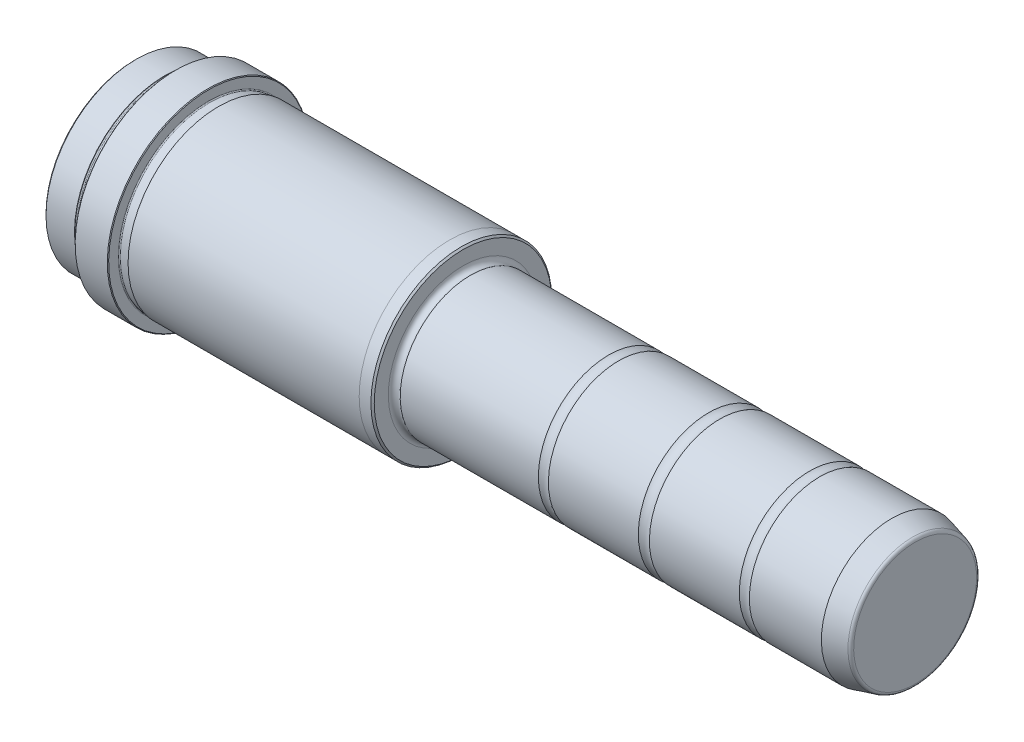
ISO-10303-21;
HEADER;
FILE_DESCRIPTION(('STEP AP214'),'2;1');
FILE_NAME('part.step','',(''),(''),'','','');
FILE_SCHEMA(('AUTOMOTIVE_DESIGN { 1 0 10303 214 1 1 1 1 }'));
ENDSEC;
DATA;
#1=APPLICATION_CONTEXT('core data for automotive mechanical design processes');
#2=APPLICATION_PROTOCOL_DEFINITION('international standard','automotive_design',2000,#1);
#3=PRODUCT_CONTEXT('',#1,'mechanical');
#4=PRODUCT('Part','Part','',(#3));
#5=PRODUCT_RELATED_PRODUCT_CATEGORY('part','',(#4));
#6=PRODUCT_DEFINITION_FORMATION('','',#4);
#7=PRODUCT_DEFINITION_CONTEXT('part definition',#1,'design');
#8=PRODUCT_DEFINITION('design','',#6,#7);
#9=PRODUCT_DEFINITION_SHAPE('','',#8);
#10=(LENGTH_UNIT() NAMED_UNIT(*) SI_UNIT(.MILLI.,.METRE.));
#11=(NAMED_UNIT(*) PLANE_ANGLE_UNIT() SI_UNIT($,.RADIAN.));
#12=(NAMED_UNIT(*) SI_UNIT($,.STERADIAN.) SOLID_ANGLE_UNIT());
#13=UNCERTAINTY_MEASURE_WITH_UNIT(LENGTH_MEASURE(1.E-05),#10,'distance_accuracy_value','');
#14=(GEOMETRIC_REPRESENTATION_CONTEXT(3) GLOBAL_UNCERTAINTY_ASSIGNED_CONTEXT((#13)) GLOBAL_UNIT_ASSIGNED_CONTEXT((#10,
#11,#12)) REPRESENTATION_CONTEXT('',''));
#15=CARTESIAN_POINT('',(0.,0.,0.));
#16=DIRECTION('',(0.,0.,1.));
#17=DIRECTION('',(1.,0.,0.));
#18=AXIS2_PLACEMENT_3D('',#15,#16,#17);
#19=CARTESIAN_POINT('',(135.,0.,0.));
#20=DIRECTION('',(1.,0.,0.));
#21=DIRECTION('',(0.,1.,0.));
#22=AXIS2_PLACEMENT_3D('',#19,#20,#21);
#23=CYLINDRICAL_SURFACE('',#22,21.);
#24=CARTESIAN_POINT('',(2.24833147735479,0.,0.));
#25=DIRECTION('',(1.,0.,0.));
#26=DIRECTION('',(0.,1.,0.));
#27=AXIS2_PLACEMENT_3D('',#24,#25,#26);
#28=CIRCLE('',#27,21.);
#29=CARTESIAN_POINT('',(2.24833147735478,21.,0.));
#30=VERTEX_POINT('',#29);
#31=EDGE_CURVE('E105',#30,#30,#28,.T.);
#32=ORIENTED_EDGE('',*,*,#31,.T.);
#33=EDGE_LOOP('',(#32));
#34=FACE_BOUND('',#33,.T.);
#35=CARTESIAN_POINT('',(43.5033370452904,0.,0.));
#36=DIRECTION('',(-1.,0.,0.));
#37=DIRECTION('',(0.,-1.,0.));
#38=AXIS2_PLACEMENT_3D('',#35,#36,#37);
#39=CIRCLE('',#38,21.);
#40=CARTESIAN_POINT('',(43.5033370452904,-20.9999999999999,0.));
#41=VERTEX_POINT('',#40);
#42=EDGE_CURVE('E126',#41,#41,#39,.T.);
#43=ORIENTED_EDGE('',*,*,#42,.T.);
#44=EDGE_LOOP('',(#43));
#45=FACE_BOUND('',#44,.T.);
#46=ADVANCED_FACE('F28',(#34,#45),#23,.T.);
#47=CARTESIAN_POINT('',(-98.,27.,0.));
#48=DIRECTION('',(-1.,0.,0.));
#49=DIRECTION('',(0.,-1.,0.));
#50=AXIS2_PLACEMENT_3D('',#47,#48,#49);
#51=PLANE('',#50);
#52=CARTESIAN_POINT('',(-98.,0.,0.));
#53=DIRECTION('',(-1.,0.,0.));
#54=DIRECTION('',(0.,-1.,0.));
#55=AXIS2_PLACEMENT_3D('',#52,#53,#54);
#56=CIRCLE('',#55,26.5000000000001);
#57=CARTESIAN_POINT('',(-97.9999999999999,-26.5000000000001,0.));
#58=VERTEX_POINT('',#57);
#59=EDGE_CURVE('E39',#58,#58,#56,.T.);
#60=ORIENTED_EDGE('',*,*,#59,.T.);
#61=EDGE_LOOP('',(#60));
#62=FACE_BOUND('',#61,.T.);
#63=ADVANCED_FACE('F149',(#62),#51,.T.);
#64=CARTESIAN_POINT('',(135.,0.,0.));
#65=DIRECTION('',(1.,0.,0.));
#66=DIRECTION('',(0.,1.,0.));
#67=AXIS2_PLACEMENT_3D('',#64,#65,#66);
#68=CYLINDRICAL_SURFACE('',#67,27.);
#69=CARTESIAN_POINT('',(-97.5,0.,0.));
#70=DIRECTION('',(-1.,0.,0.));
#71=DIRECTION('',(0.,-1.,0.));
#72=AXIS2_PLACEMENT_3D('',#69,#70,#71);
#73=CIRCLE('',#72,27.);
#74=CARTESIAN_POINT('',(-97.5,-27.,0.));
#75=VERTEX_POINT('',#74);
#76=EDGE_CURVE('E43',#75,#75,#73,.F.);
#77=ORIENTED_EDGE('',*,*,#76,.T.);
#78=EDGE_LOOP('',(#77));
#79=FACE_BOUND('',#78,.T.);
#80=CARTESIAN_POINT('',(-89.,0.,0.));
#81=DIRECTION('',(1.,0.,0.));
#82=DIRECTION('',(0.,1.,0.));
#83=AXIS2_PLACEMENT_3D('',#80,#81,#82);
#84=CIRCLE('',#83,27.);
#85=CARTESIAN_POINT('',(-89.,27.,0.));
#86=VERTEX_POINT('',#85);
#87=EDGE_CURVE('E66',#86,#86,#84,.T.);
#88=ORIENTED_EDGE('',*,*,#87,.F.);
#89=EDGE_LOOP('',(#88));
#90=FACE_BOUND('',#89,.T.);
#91=ADVANCED_FACE('F157',(#79,#90),#68,.T.);
#92=CARTESIAN_POINT('',(-89.,26.9,0.));
#93=DIRECTION('',(1.,0.,0.));
#94=DIRECTION('',(0.,1.,0.));
#95=AXIS2_PLACEMENT_3D('',#92,#93,#94);
#96=PLANE('',#95);
#97=ORIENTED_EDGE('',*,*,#87,.T.);
#98=EDGE_LOOP('',(#97));
#99=FACE_BOUND('',#98,.T.);
#100=CARTESIAN_POINT('',(-89.,0.,0.));
#101=DIRECTION('',(1.,0.,0.));
#102=DIRECTION('',(0.,1.,0.));
#103=AXIS2_PLACEMENT_3D('',#100,#101,#102);
#104=CIRCLE('',#103,26.9);
#105=CARTESIAN_POINT('',(-89.,26.9,0.));
#106=VERTEX_POINT('',#105);
#107=EDGE_CURVE('E69',#106,#106,#104,.T.);
#108=ORIENTED_EDGE('',*,*,#107,.F.);
#109=EDGE_LOOP('',(#108));
#110=FACE_BOUND('',#109,.T.);
#111=ADVANCED_FACE('F405',(#99,#110),#96,.T.);
#112=CARTESIAN_POINT('',(-88.7,0.,0.));
#113=DIRECTION('',(1.,0.,0.));
#114=DIRECTION('',(0.,1.,0.));
#115=AXIS2_PLACEMENT_3D('',#112,#113,#114);
#116=TOROIDAL_SURFACE('',#115,26.9,0.299999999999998);
#117=ORIENTED_EDGE('',*,*,#107,.T.);
#118=EDGE_LOOP('',(#117));
#119=FACE_BOUND('',#118,.T.);
#120=CARTESIAN_POINT('',(-88.7,0.,0.));
#121=DIRECTION('',(1.,0.,0.));
#122=DIRECTION('',(0.,1.,0.));
#123=AXIS2_PLACEMENT_3D('',#120,#121,#122);
#124=CIRCLE('',#123,26.6);
#125=CARTESIAN_POINT('',(-88.7,26.6,0.));
#126=VERTEX_POINT('',#125);
#127=EDGE_CURVE('E72',#126,#126,#124,.T.);
#128=ORIENTED_EDGE('',*,*,#127,.F.);
#129=EDGE_LOOP('',(#128));
#130=FACE_BOUND('',#129,.T.);
#131=ADVANCED_FACE('F396',(#119,#130),#116,.F.);
#132=CARTESIAN_POINT('',(135.,0.,0.));
#133=DIRECTION('',(1.,0.,0.));
#134=DIRECTION('',(0.,1.,0.));
#135=AXIS2_PLACEMENT_3D('',#132,#133,#134);
#136=CYLINDRICAL_SURFACE('',#135,26.6);
#137=ORIENTED_EDGE('',*,*,#127,.T.);
#138=EDGE_LOOP('',(#137));
#139=FACE_BOUND('',#138,.T.);
#140=CARTESIAN_POINT('',(-86.3,0.,0.));
#141=DIRECTION('',(1.,0.,0.));
#142=DIRECTION('',(0.,1.,0.));
#143=AXIS2_PLACEMENT_3D('',#140,#141,#142);
#144=CIRCLE('',#143,26.6);
#145=CARTESIAN_POINT('',(-86.3,26.6,0.));
#146=VERTEX_POINT('',#145);
#147=EDGE_CURVE('E75',#146,#146,#144,.T.);
#148=ORIENTED_EDGE('',*,*,#147,.F.);
#149=EDGE_LOOP('',(#148));
#150=FACE_BOUND('',#149,.T.);
#151=ADVANCED_FACE('F387',(#139,#150),#136,.T.);
#152=CARTESIAN_POINT('',(-86.3,0.,0.));
#153=DIRECTION('',(1.,0.,0.));
#154=DIRECTION('',(0.,1.,0.));
#155=AXIS2_PLACEMENT_3D('',#152,#153,#154);
#156=TOROIDAL_SURFACE('',#155,26.9,0.299999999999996);
#157=ORIENTED_EDGE('',*,*,#147,.T.);
#158=EDGE_LOOP('',(#157));
#159=FACE_BOUND('',#158,.T.);
#160=CARTESIAN_POINT('',(-86.,0.,0.));
#161=DIRECTION('',(1.,0.,0.));
#162=DIRECTION('',(0.,1.,0.));
#163=AXIS2_PLACEMENT_3D('',#160,#161,#162);
#164=CIRCLE('',#163,26.9);
#165=CARTESIAN_POINT('',(-86.,26.9,0.));
#166=VERTEX_POINT('',#165);
#167=EDGE_CURVE('E78',#166,#166,#164,.T.);
#168=ORIENTED_EDGE('',*,*,#167,.F.);
#169=EDGE_LOOP('',(#168));
#170=FACE_BOUND('',#169,.T.);
#171=ADVANCED_FACE('F379',(#159,#170),#156,.F.);
#172=CARTESIAN_POINT('',(-86.,30.,0.));
#173=DIRECTION('',(-1.,0.,0.));
#174=DIRECTION('',(0.,-1.,0.));
#175=AXIS2_PLACEMENT_3D('',#172,#173,#174);
#176=PLANE('',#175);
#177=CARTESIAN_POINT('',(-86.,0.,0.));
#178=DIRECTION('',(-1.,0.,0.));
#179=DIRECTION('',(0.,-1.,0.));
#180=AXIS2_PLACEMENT_3D('',#177,#178,#179);
#181=CIRCLE('',#180,29.8);
#182=CARTESIAN_POINT('',(-86.,-29.8,0.));
#183=VERTEX_POINT('',#182);
#184=EDGE_CURVE('E51',#183,#183,#181,.T.);
#185=ORIENTED_EDGE('',*,*,#184,.T.);
#186=EDGE_LOOP('',(#185));
#187=FACE_BOUND('',#186,.T.);
#188=ORIENTED_EDGE('',*,*,#167,.T.);
#189=EDGE_LOOP('',(#188));
#190=FACE_BOUND('',#189,.T.);
#191=ADVANCED_FACE('F371',(#187,#190),#176,.T.);
#192=CARTESIAN_POINT('',(135.,0.,0.));
#193=DIRECTION('',(1.,0.,0.));
#194=DIRECTION('',(0.,1.,0.));
#195=AXIS2_PLACEMENT_3D('',#192,#193,#194);
#196=CYLINDRICAL_SURFACE('',#195,30.);
#197=CARTESIAN_POINT('',(-85.8,0.,0.));
#198=DIRECTION('',(-1.,0.,0.));
#199=DIRECTION('',(0.,-1.,0.));
#200=AXIS2_PLACEMENT_3D('',#197,#198,#199);
#201=CIRCLE('',#200,30.);
#202=CARTESIAN_POINT('',(-85.8,-30.,0.));
#203=VERTEX_POINT('',#202);
#204=EDGE_CURVE('E54',#203,#203,#201,.F.);
#205=ORIENTED_EDGE('',*,*,#204,.T.);
#206=EDGE_LOOP('',(#205));
#207=FACE_BOUND('',#206,.T.);
#208=CARTESIAN_POINT('',(-76.2,0.,0.));
#209=DIRECTION('',(1.,0.,0.));
#210=DIRECTION('',(0.,1.,0.));
#211=AXIS2_PLACEMENT_3D('',#208,#209,#210);
#212=CIRCLE('',#211,30.);
#213=CARTESIAN_POINT('',(-76.1999999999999,-30.,0.));
#214=VERTEX_POINT('',#213);
#215=EDGE_CURVE('E57',#214,#214,#212,.F.);
#216=ORIENTED_EDGE('',*,*,#215,.T.);
#217=EDGE_LOOP('',(#216));
#218=FACE_BOUND('',#217,.T.);
#219=ADVANCED_FACE('F362',(#207,#218),#196,.T.);
#220=CARTESIAN_POINT('',(-76.,26.9,0.));
#221=DIRECTION('',(1.,0.,0.));
#222=DIRECTION('',(0.,1.,0.));
#223=AXIS2_PLACEMENT_3D('',#220,#221,#222);
#224=PLANE('',#223);
#225=CARTESIAN_POINT('',(-76.,0.,0.));
#226=DIRECTION('',(1.,0.,0.));
#227=DIRECTION('',(0.,1.,0.));
#228=AXIS2_PLACEMENT_3D('',#225,#226,#227);
#229=CIRCLE('',#228,29.8);
#230=CARTESIAN_POINT('',(-76.,-29.8,0.));
#231=VERTEX_POINT('',#230);
#232=EDGE_CURVE('E48',#231,#231,#229,.T.);
#233=ORIENTED_EDGE('',*,*,#232,.T.);
#234=EDGE_LOOP('',(#233));
#235=FACE_BOUND('',#234,.T.);
#236=CARTESIAN_POINT('',(-76.,0.,0.));
#237=DIRECTION('',(1.,0.,0.));
#238=DIRECTION('',(0.,1.,0.));
#239=AXIS2_PLACEMENT_3D('',#236,#237,#238);
#240=CIRCLE('',#239,26.9);
#241=CARTESIAN_POINT('',(-76.,26.9,0.));
#242=VERTEX_POINT('',#241);
#243=EDGE_CURVE('E81',#242,#242,#240,.T.);
#244=ORIENTED_EDGE('',*,*,#243,.F.);
#245=EDGE_LOOP('',(#244));
#246=FACE_BOUND('',#245,.T.);
#247=ADVANCED_FACE('F353',(#235,#246),#224,.T.);
#248=CARTESIAN_POINT('',(-75.7,0.,0.));
#249=DIRECTION('',(1.,0.,0.));
#250=DIRECTION('',(0.,1.,0.));
#251=AXIS2_PLACEMENT_3D('',#248,#249,#250);
#252=TOROIDAL_SURFACE('',#251,26.9,0.299999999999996);
#253=ORIENTED_EDGE('',*,*,#243,.T.);
#254=EDGE_LOOP('',(#253));
#255=FACE_BOUND('',#254,.T.);
#256=CARTESIAN_POINT('',(-75.7,0.,0.));
#257=DIRECTION('',(1.,0.,0.));
#258=DIRECTION('',(0.,1.,0.));
#259=AXIS2_PLACEMENT_3D('',#256,#257,#258);
#260=CIRCLE('',#259,26.6);
#261=CARTESIAN_POINT('',(-75.7,26.6,0.));
#262=VERTEX_POINT('',#261);
#263=EDGE_CURVE('E84',#262,#262,#260,.T.);
#264=ORIENTED_EDGE('',*,*,#263,.F.);
#265=EDGE_LOOP('',(#264));
#266=FACE_BOUND('',#265,.T.);
#267=ADVANCED_FACE('F344',(#255,#266),#252,.F.);
#268=CARTESIAN_POINT('',(135.,0.,0.));
#269=DIRECTION('',(1.,0.,0.));
#270=DIRECTION('',(0.,1.,0.));
#271=AXIS2_PLACEMENT_3D('',#268,#269,#270);
#272=CYLINDRICAL_SURFACE('',#271,26.6);
#273=ORIENTED_EDGE('',*,*,#263,.T.);
#274=EDGE_LOOP('',(#273));
#275=FACE_BOUND('',#274,.T.);
#276=CARTESIAN_POINT('',(-73.3,0.,0.));
#277=DIRECTION('',(1.,0.,0.));
#278=DIRECTION('',(0.,1.,0.));
#279=AXIS2_PLACEMENT_3D('',#276,#277,#278);
#280=CIRCLE('',#279,26.6);
#281=CARTESIAN_POINT('',(-73.3,26.6,0.));
#282=VERTEX_POINT('',#281);
#283=EDGE_CURVE('E87',#282,#282,#280,.T.);
#284=ORIENTED_EDGE('',*,*,#283,.F.);
#285=EDGE_LOOP('',(#284));
#286=FACE_BOUND('',#285,.T.);
#287=ADVANCED_FACE('F335',(#275,#286),#272,.T.);
#288=CARTESIAN_POINT('',(-73.3,0.,0.));
#289=DIRECTION('',(1.,0.,0.));
#290=DIRECTION('',(0.,1.,0.));
#291=AXIS2_PLACEMENT_3D('',#288,#289,#290);
#292=TOROIDAL_SURFACE('',#291,26.9,0.299999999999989);
#293=ORIENTED_EDGE('',*,*,#283,.T.);
#294=EDGE_LOOP('',(#293));
#295=FACE_BOUND('',#294,.T.);
#296=CARTESIAN_POINT('',(-73.,0.,0.));
#297=DIRECTION('',(1.,0.,0.));
#298=DIRECTION('',(0.,1.,0.));
#299=AXIS2_PLACEMENT_3D('',#296,#297,#298);
#300=CIRCLE('',#299,26.9);
#301=CARTESIAN_POINT('',(-73.,26.9,0.));
#302=VERTEX_POINT('',#301);
#303=EDGE_CURVE('E90',#302,#302,#300,.T.);
#304=ORIENTED_EDGE('',*,*,#303,.F.);
#305=EDGE_LOOP('',(#304));
#306=FACE_BOUND('',#305,.T.);
#307=ADVANCED_FACE('F326',(#295,#306),#292,.F.);
#308=CARTESIAN_POINT('',(-73.,27.0001,0.));
#309=DIRECTION('',(-1.,0.,0.));
#310=DIRECTION('',(0.,-1.,0.));
#311=AXIS2_PLACEMENT_3D('',#308,#309,#310);
#312=PLANE('',#311);
#313=ORIENTED_EDGE('',*,*,#303,.T.);
#314=EDGE_LOOP('',(#313));
#315=FACE_BOUND('',#314,.T.);
#316=CARTESIAN_POINT('',(-73.,0.,0.));
#317=DIRECTION('',(1.,0.,0.));
#318=DIRECTION('',(0.,1.,0.));
#319=AXIS2_PLACEMENT_3D('',#316,#317,#318);
#320=CIRCLE('',#319,27.0001);
#321=CARTESIAN_POINT('',(-73.,27.0001,0.));
#322=VERTEX_POINT('',#321);
#323=EDGE_CURVE('E93',#322,#322,#320,.T.);
#324=ORIENTED_EDGE('',*,*,#323,.F.);
#325=EDGE_LOOP('',(#324));
#326=FACE_BOUND('',#325,.T.);
#327=ADVANCED_FACE('F317',(#315,#326),#312,.T.);
#328=CARTESIAN_POINT('',(135.,0.,0.));
#329=DIRECTION('',(1.,0.,0.));
#330=DIRECTION('',(0.,1.,0.));
#331=AXIS2_PLACEMENT_3D('',#328,#329,#330);
#332=CYLINDRICAL_SURFACE('',#331,27.0001);
#333=ORIENTED_EDGE('',*,*,#323,.T.);
#334=EDGE_LOOP('',(#333));
#335=FACE_BOUND('',#334,.T.);
#336=CARTESIAN_POINT('',(-4.,0.,0.));
#337=DIRECTION('',(1.,0.,0.));
#338=DIRECTION('',(0.,1.,0.));
#339=AXIS2_PLACEMENT_3D('',#336,#337,#338);
#340=CIRCLE('',#339,27.0001);
#341=CARTESIAN_POINT('',(-4.00000000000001,27.0001,0.));
#342=VERTEX_POINT('',#341);
#343=EDGE_CURVE('E96',#342,#342,#340,.T.);
#344=ORIENTED_EDGE('',*,*,#343,.F.);
#345=EDGE_LOOP('',(#344));
#346=FACE_BOUND('',#345,.T.);
#347=ADVANCED_FACE('F308',(#335,#346),#332,.T.);
#348=CARTESIAN_POINT('',(-4.,27.0001,0.));
#349=DIRECTION('',(1.,0.,0.));
#350=DIRECTION('',(0.,1.,0.));
#351=AXIS2_PLACEMENT_3D('',#348,#349,#350);
#352=PLANE('',#351);
#353=ORIENTED_EDGE('',*,*,#343,.T.);
#354=EDGE_LOOP('',(#353));
#355=FACE_BOUND('',#354,.T.);
#356=CARTESIAN_POINT('',(-4.,0.,0.));
#357=DIRECTION('',(1.,0.,0.));
#358=DIRECTION('',(0.,1.,0.));
#359=AXIS2_PLACEMENT_3D('',#356,#357,#358);
#360=CIRCLE('',#359,27.);
#361=CARTESIAN_POINT('',(-4.00000000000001,27.,0.));
#362=VERTEX_POINT('',#361);
#363=EDGE_CURVE('E99',#362,#362,#360,.T.);
#364=ORIENTED_EDGE('',*,*,#363,.F.);
#365=EDGE_LOOP('',(#364));
#366=FACE_BOUND('',#365,.T.);
#367=ADVANCED_FACE('F300',(#355,#366),#352,.T.);
#368=CARTESIAN_POINT('',(135.,0.,0.));
#369=DIRECTION('',(1.,0.,0.));
#370=DIRECTION('',(0.,1.,0.));
#371=AXIS2_PLACEMENT_3D('',#368,#369,#370);
#372=CYLINDRICAL_SURFACE('',#371,27.);
#373=CARTESIAN_POINT('',(-0.499999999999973,0.,0.));
#374=DIRECTION('',(1.,0.,0.));
#375=DIRECTION('',(0.,1.,0.));
#376=AXIS2_PLACEMENT_3D('',#373,#374,#375);
#377=CIRCLE('',#376,27.);
#378=CARTESIAN_POINT('',(-0.499999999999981,27.,0.));
#379=VERTEX_POINT('',#378);
#380=EDGE_CURVE('E10',#379,#379,#377,.F.);
#381=ORIENTED_EDGE('',*,*,#380,.T.);
#382=EDGE_LOOP('',(#381));
#383=FACE_BOUND('',#382,.T.);
#384=ORIENTED_EDGE('',*,*,#363,.T.);
#385=EDGE_LOOP('',(#384));
#386=FACE_BOUND('',#385,.T.);
#387=ADVANCED_FACE('F292',(#383,#386),#372,.T.);
#388=CARTESIAN_POINT('',(0.,22.3,0.));
#389=DIRECTION('',(1.,0.,0.));
#390=DIRECTION('',(0.,1.,0.));
#391=AXIS2_PLACEMENT_3D('',#388,#389,#390);
#392=PLANE('',#391);
#393=CARTESIAN_POINT('',(0.,0.,0.));
#394=DIRECTION('',(1.,0.,0.));
#395=DIRECTION('',(0.,1.,0.));
#396=AXIS2_PLACEMENT_3D('',#393,#394,#395);
#397=CIRCLE('',#396,26.5);
#398=CARTESIAN_POINT('',(0.,26.5,0.));
#399=VERTEX_POINT('',#398);
#400=EDGE_CURVE('E35',#399,#399,#397,.T.);
#401=ORIENTED_EDGE('',*,*,#400,.T.);
#402=EDGE_LOOP('',(#401));
#403=FACE_BOUND('',#402,.T.);
#404=CARTESIAN_POINT('',(0.,0.,0.));
#405=DIRECTION('',(1.,0.,0.));
#406=DIRECTION('',(0.,1.,0.));
#407=AXIS2_PLACEMENT_3D('',#404,#405,#406);
#408=CIRCLE('',#407,22.3);
#409=CARTESIAN_POINT('',(0.,22.3,0.));
#410=VERTEX_POINT('',#409);
#411=EDGE_CURVE('E102',#410,#410,#408,.T.);
#412=ORIENTED_EDGE('',*,*,#411,.F.);
#413=EDGE_LOOP('',(#412));
#414=FACE_BOUND('',#413,.T.);
#415=ADVANCED_FACE('F144',(#403,#414),#392,.T.);
#416=CARTESIAN_POINT('',(1.5,0.,0.));
#417=DIRECTION('',(1.,0.,0.));
#418=DIRECTION('',(0.,1.,0.));
#419=AXIS2_PLACEMENT_3D('',#416,#417,#418);
#420=TOROIDAL_SURFACE('',#419,22.3,1.5);
#421=ORIENTED_EDGE('',*,*,#411,.T.);
#422=EDGE_LOOP('',(#421));
#423=FACE_BOUND('',#422,.T.);
#424=ORIENTED_EDGE('',*,*,#31,.F.);
#425=EDGE_LOOP('',(#424));
#426=FACE_BOUND('',#425,.T.);
#427=ADVANCED_FACE('F134',(#423,#426),#420,.F.);
#428=CARTESIAN_POINT('',(45.,0.,0.));
#429=DIRECTION('',(-1.,0.,0.));
#430=DIRECTION('',(0.,-1.,0.));
#431=AXIS2_PLACEMENT_3D('',#428,#429,#430);
#432=TOROIDAL_SURFACE('',#431,23.6,3.);
#433=CARTESIAN_POINT('',(46.4966629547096,0.,0.));
#434=DIRECTION('',(-1.,0.,0.));
#435=DIRECTION('',(0.,-1.,0.));
#436=AXIS2_PLACEMENT_3D('',#433,#434,#435);
#437=CIRCLE('',#436,21.);
#438=CARTESIAN_POINT('',(46.4966629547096,-20.9999999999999,0.));
#439=VERTEX_POINT('',#438);
#440=EDGE_CURVE('E123',#439,#439,#437,.T.);
#441=ORIENTED_EDGE('',*,*,#440,.T.);
#442=EDGE_LOOP('',(#441));
#443=FACE_BOUND('',#442,.T.);
#444=ORIENTED_EDGE('',*,*,#42,.F.);
#445=EDGE_LOOP('',(#444));
#446=FACE_BOUND('',#445,.T.);
#447=ADVANCED_FACE('F131',(#443,#446),#432,.F.);
#448=CARTESIAN_POINT('',(135.,19.1243556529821,0.));
#449=DIRECTION('',(1.,0.,0.));
#450=DIRECTION('',(0.,1.,0.));
#451=AXIS2_PLACEMENT_3D('',#448,#449,#450);
#452=PLANE('',#451);
#453=CARTESIAN_POINT('',(135.,0.,0.));
#454=DIRECTION('',(1.,0.,0.));
#455=DIRECTION('',(0.,1.,0.));
#456=AXIS2_PLACEMENT_3D('',#453,#454,#455);
#457=CIRCLE('',#456,18.3570286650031);
#458=CARTESIAN_POINT('',(135.,18.3570286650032,0.));
#459=VERTEX_POINT('',#458);
#460=EDGE_CURVE('E63',#459,#459,#457,.T.);
#461=ORIENTED_EDGE('',*,*,#460,.T.);
#462=EDGE_LOOP('',(#461));
#463=FACE_BOUND('',#462,.T.);
#464=ADVANCED_FACE('F133',(#463),#452,.T.);
#465=CARTESIAN_POINT('',(135.,0.,0.));
#466=DIRECTION('',(-1.,0.,0.));
#467=DIRECTION('',(0.,-1.,0.));
#468=AXIS2_PLACEMENT_3D('',#465,#466,#467);
#469=CONICAL_SURFACE('',#468,19.1243556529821,0.26179938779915);
#470=CARTESIAN_POINT('',(134.258819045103,0.,0.));
#471=DIRECTION('',(1.,0.,0.));
#472=DIRECTION('',(0.,1.,0.));
#473=AXIS2_PLACEMENT_3D('',#470,#471,#472);
#474=CIRCLE('',#473,19.3229544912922);
#475=CARTESIAN_POINT('',(134.258819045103,19.3229544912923,0.));
#476=VERTEX_POINT('',#475);
#477=EDGE_CURVE('E60',#476,#476,#474,.F.);
#478=ORIENTED_EDGE('',*,*,#477,.T.);
#479=EDGE_LOOP('',(#478));
#480=FACE_BOUND('',#479,.T.);
#481=CARTESIAN_POINT('',(128.,0.,0.));
#482=DIRECTION('',(1.,0.,0.));
#483=DIRECTION('',(0.,1.,0.));
#484=AXIS2_PLACEMENT_3D('',#481,#482,#483);
#485=CIRCLE('',#484,21.);
#486=CARTESIAN_POINT('',(128.,21.,0.));
#487=VERTEX_POINT('',#486);
#488=EDGE_CURVE('E108',#487,#487,#485,.T.);
#489=ORIENTED_EDGE('',*,*,#488,.T.);
#490=EDGE_LOOP('',(#489));
#491=FACE_BOUND('',#490,.T.);
#492=ADVANCED_FACE('F141',(#480,#491),#469,.T.);
#493=ORIENTED_EDGE('',*,*,#488,.F.);
#494=EDGE_LOOP('',(#493));
#495=FACE_BOUND('',#494,.T.);
#496=CARTESIAN_POINT('',(106.49666295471,0.,0.));
#497=DIRECTION('',(-1.,0.,0.));
#498=DIRECTION('',(0.,-1.,0.));
#499=AXIS2_PLACEMENT_3D('',#496,#497,#498);
#500=CIRCLE('',#499,21.);
#501=CARTESIAN_POINT('',(106.49666295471,-20.9999999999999,0.));
#502=VERTEX_POINT('',#501);
#503=EDGE_CURVE('E111',#502,#502,#500,.T.);
#504=ORIENTED_EDGE('',*,*,#503,.F.);
#505=EDGE_LOOP('',(#504));
#506=FACE_BOUND('',#505,.T.);
#507=ADVANCED_FACE('F153',(#495,#506),#23,.T.);
#508=CARTESIAN_POINT('',(105.,0.,0.));
#509=DIRECTION('',(-1.,0.,0.));
#510=DIRECTION('',(0.,-1.,0.));
#511=AXIS2_PLACEMENT_3D('',#508,#509,#510);
#512=TOROIDAL_SURFACE('',#511,23.6,3.);
#513=ORIENTED_EDGE('',*,*,#503,.T.);
#514=EDGE_LOOP('',(#513));
#515=FACE_BOUND('',#514,.T.);
#516=CARTESIAN_POINT('',(103.50333704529,0.,0.));
#517=DIRECTION('',(-1.,0.,0.));
#518=DIRECTION('',(0.,-1.,0.));
#519=AXIS2_PLACEMENT_3D('',#516,#517,#518);
#520=CIRCLE('',#519,21.);
#521=CARTESIAN_POINT('',(103.50333704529,-20.9999999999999,0.));
#522=VERTEX_POINT('',#521);
#523=EDGE_CURVE('E114',#522,#522,#520,.T.);
#524=ORIENTED_EDGE('',*,*,#523,.F.);
#525=EDGE_LOOP('',(#524));
#526=FACE_BOUND('',#525,.T.);
#527=ADVANCED_FACE('F167',(#515,#526),#512,.F.);
#528=ORIENTED_EDGE('',*,*,#523,.T.);
#529=EDGE_LOOP('',(#528));
#530=FACE_BOUND('',#529,.T.);
#531=CARTESIAN_POINT('',(76.6583123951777,0.,0.));
#532=DIRECTION('',(-1.,0.,0.));
#533=DIRECTION('',(0.,-1.,0.));
#534=AXIS2_PLACEMENT_3D('',#531,#532,#533);
#535=CIRCLE('',#534,21.);
#536=CARTESIAN_POINT('',(76.6583123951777,-20.9999999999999,0.));
#537=VERTEX_POINT('',#536);
#538=EDGE_CURVE('E117',#537,#537,#535,.T.);
#539=ORIENTED_EDGE('',*,*,#538,.F.);
#540=EDGE_LOOP('',(#539));
#541=FACE_BOUND('',#540,.T.);
#542=ADVANCED_FACE('F165',(#530,#541),#23,.T.);
#543=CARTESIAN_POINT('',(75.,0.,0.));
#544=DIRECTION('',(-1.,0.,0.));
#545=DIRECTION('',(0.,-1.,0.));
#546=AXIS2_PLACEMENT_3D('',#543,#544,#545);
#547=TOROIDAL_SURFACE('',#546,23.5,3.);
#548=ORIENTED_EDGE('',*,*,#538,.T.);
#549=EDGE_LOOP('',(#548));
#550=FACE_BOUND('',#549,.T.);
#551=CARTESIAN_POINT('',(73.3416876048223,0.,0.));
#552=DIRECTION('',(-1.,0.,0.));
#553=DIRECTION('',(0.,-1.,0.));
#554=AXIS2_PLACEMENT_3D('',#551,#552,#553);
#555=CIRCLE('',#554,21.);
#556=CARTESIAN_POINT('',(73.3416876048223,-20.9999999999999,0.));
#557=VERTEX_POINT('',#556);
#558=EDGE_CURVE('E120',#557,#557,#555,.T.);
#559=ORIENTED_EDGE('',*,*,#558,.F.);
#560=EDGE_LOOP('',(#559));
#561=FACE_BOUND('',#560,.T.);
#562=ADVANCED_FACE('F163',(#550,#561),#547,.F.);
#563=ORIENTED_EDGE('',*,*,#558,.T.);
#564=EDGE_LOOP('',(#563));
#565=FACE_BOUND('',#564,.T.);
#566=ORIENTED_EDGE('',*,*,#440,.F.);
#567=EDGE_LOOP('',(#566));
#568=FACE_BOUND('',#567,.T.);
#569=ADVANCED_FACE('F152',(#565,#568),#23,.T.);
#570=CARTESIAN_POINT('',(134.,0.,0.));
#571=DIRECTION('',(1.,0.,0.));
#572=DIRECTION('',(0.,1.,0.));
#573=AXIS2_PLACEMENT_3D('',#570,#571,#572);
#574=TOROIDAL_SURFACE('',#573,18.3570286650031,1.);
#575=ORIENTED_EDGE('',*,*,#477,.F.);
#576=EDGE_LOOP('',(#575));
#577=FACE_BOUND('',#576,.T.);
#578=ORIENTED_EDGE('',*,*,#460,.F.);
#579=EDGE_LOOP('',(#578));
#580=FACE_BOUND('',#579,.T.);
#581=ADVANCED_FACE('F162',(#577,#580),#574,.T.);
#582=CARTESIAN_POINT('',(-85.8,0.,0.));
#583=DIRECTION('',(1.,0.,0.));
#584=DIRECTION('',(0.,1.,0.));
#585=AXIS2_PLACEMENT_3D('',#582,#583,#584);
#586=CONICAL_SURFACE('',#585,30.,0.785398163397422);
#587=ORIENTED_EDGE('',*,*,#184,.F.);
#588=EDGE_LOOP('',(#587));
#589=FACE_BOUND('',#588,.T.);
#590=ORIENTED_EDGE('',*,*,#204,.F.);
#591=EDGE_LOOP('',(#590));
#592=FACE_BOUND('',#591,.T.);
#593=ADVANCED_FACE('F205',(#589,#592),#586,.T.);
#594=CARTESIAN_POINT('',(-76.,0.,0.));
#595=DIRECTION('',(-1.,0.,0.));
#596=DIRECTION('',(0.,-1.,0.));
#597=AXIS2_PLACEMENT_3D('',#594,#595,#596);
#598=CONICAL_SURFACE('',#597,29.8,0.785398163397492);
#599=CARTESIAN_POINT('',(-76.1999999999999,-30.,0.));
#600=CARTESIAN_POINT('',(-76.1979166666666,-29.9979166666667,0.));
#601=CARTESIAN_POINT('',(-76.1958333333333,-29.9958333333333,0.));
#602=CARTESIAN_POINT('',(-76.1916666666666,-29.9916666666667,0.));
#603=CARTESIAN_POINT('',(-76.1895833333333,-29.9895833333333,0.));
#604=CARTESIAN_POINT('',(-76.1854166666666,-29.9854166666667,0.));
#605=CARTESIAN_POINT('',(-76.1833333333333,-29.9833333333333,0.));
#606=CARTESIAN_POINT('',(-76.1791666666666,-29.9791666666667,0.));
#607=CARTESIAN_POINT('',(-76.1770833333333,-29.9770833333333,0.));
#608=CARTESIAN_POINT('',(-76.1729166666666,-29.9729166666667,0.));
#609=CARTESIAN_POINT('',(-76.1708333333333,-29.9708333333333,0.));
#610=CARTESIAN_POINT('',(-76.1666666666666,-29.9666666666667,0.));
#611=CARTESIAN_POINT('',(-76.1645833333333,-29.9645833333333,0.));
#612=CARTESIAN_POINT('',(-76.1604166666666,-29.9604166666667,0.));
#613=CARTESIAN_POINT('',(-76.1583333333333,-29.9583333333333,0.));
#614=CARTESIAN_POINT('',(-76.1541666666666,-29.9541666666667,0.));
#615=CARTESIAN_POINT('',(-76.1520833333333,-29.9520833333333,0.));
#616=CARTESIAN_POINT('',(-76.1479166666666,-29.9479166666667,0.));
#617=CARTESIAN_POINT('',(-76.1458333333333,-29.9458333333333,0.));
#618=CARTESIAN_POINT('',(-76.1416666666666,-29.9416666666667,0.));
#619=CARTESIAN_POINT('',(-76.1395833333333,-29.9395833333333,0.));
#620=CARTESIAN_POINT('',(-76.1354166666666,-29.9354166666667,0.));
#621=CARTESIAN_POINT('',(-76.1333333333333,-29.9333333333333,0.));
#622=CARTESIAN_POINT('',(-76.1291666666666,-29.9291666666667,0.));
#623=CARTESIAN_POINT('',(-76.1270833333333,-29.9270833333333,0.));
#624=CARTESIAN_POINT('',(-76.1229166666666,-29.9229166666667,0.));
#625=CARTESIAN_POINT('',(-76.1208333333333,-29.9208333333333,0.));
#626=CARTESIAN_POINT('',(-76.1166666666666,-29.9166666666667,0.));
#627=CARTESIAN_POINT('',(-76.1145833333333,-29.9145833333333,0.));
#628=CARTESIAN_POINT('',(-76.1104166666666,-29.9104166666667,0.));
#629=CARTESIAN_POINT('',(-76.1083333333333,-29.9083333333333,0.));
#630=CARTESIAN_POINT('',(-76.1041666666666,-29.9041666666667,0.));
#631=CARTESIAN_POINT('',(-76.1020833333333,-29.9020833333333,0.));
#632=CARTESIAN_POINT('',(-76.0979166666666,-29.8979166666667,0.));
#633=CARTESIAN_POINT('',(-76.0958333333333,-29.8958333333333,0.));
#634=CARTESIAN_POINT('',(-76.0916666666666,-29.8916666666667,0.));
#635=CARTESIAN_POINT('',(-76.0895833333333,-29.8895833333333,0.));
#636=CARTESIAN_POINT('',(-76.0854166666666,-29.8854166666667,0.));
#637=CARTESIAN_POINT('',(-76.0833333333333,-29.8833333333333,0.));
#638=CARTESIAN_POINT('',(-76.0791666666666,-29.8791666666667,0.));
#639=CARTESIAN_POINT('',(-76.0770833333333,-29.8770833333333,0.));
#640=CARTESIAN_POINT('',(-76.0729166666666,-29.8729166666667,0.));
#641=CARTESIAN_POINT('',(-76.0708333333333,-29.8708333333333,0.));
#642=CARTESIAN_POINT('',(-76.0666666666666,-29.8666666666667,0.));
#643=CARTESIAN_POINT('',(-76.0645833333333,-29.8645833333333,0.));
#644=CARTESIAN_POINT('',(-76.0604166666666,-29.8604166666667,0.));
#645=CARTESIAN_POINT('',(-76.0583333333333,-29.8583333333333,0.));
#646=CARTESIAN_POINT('',(-76.0541666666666,-29.8541666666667,0.));
#647=CARTESIAN_POINT('',(-76.0520833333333,-29.8520833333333,0.));
#648=CARTESIAN_POINT('',(-76.0479166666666,-29.8479166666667,0.));
#649=CARTESIAN_POINT('',(-76.0458333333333,-29.8458333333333,0.));
#650=CARTESIAN_POINT('',(-76.0416666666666,-29.8416666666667,0.));
#651=CARTESIAN_POINT('',(-76.0395833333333,-29.8395833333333,0.));
#652=CARTESIAN_POINT('',(-76.0354166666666,-29.8354166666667,0.));
#653=CARTESIAN_POINT('',(-76.0333333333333,-29.8333333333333,0.));
#654=CARTESIAN_POINT('',(-76.0291666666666,-29.8291666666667,0.));
#655=CARTESIAN_POINT('',(-76.0270833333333,-29.8270833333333,0.));
#656=CARTESIAN_POINT('',(-76.0229166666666,-29.8229166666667,0.));
#657=CARTESIAN_POINT('',(-76.0208333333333,-29.8208333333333,0.));
#658=CARTESIAN_POINT('',(-76.0166666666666,-29.8166666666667,0.));
#659=CARTESIAN_POINT('',(-76.0145833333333,-29.8145833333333,0.));
#660=CARTESIAN_POINT('',(-76.0104166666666,-29.8104166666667,0.));
#661=CARTESIAN_POINT('',(-76.0083333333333,-29.8083333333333,0.));
#662=CARTESIAN_POINT('',(-76.0041666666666,-29.8041666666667,0.));
#663=CARTESIAN_POINT('',(-76.0020833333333,-29.8020833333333,0.));
#664=CARTESIAN_POINT('',(-76.,-29.8,0.));
#665=B_SPLINE_CURVE_WITH_KNOTS('',3,(#599,#600,#601,#602,#603,#604,#605,#606,#607,#608,#609,
#610,#611,#612,#613,#614,#615,#616,#617,#618,#619,#620,#621,#622,#623,#624,#625,#626,#627,#628,
#629,#630,#631,#632,#633,#634,#635,#636,#637,#638,#639,#640,#641,#642,#643,#644,#645,#646,#647,
#648,#649,#650,#651,#652,#653,#654,#655,#656,#657,#658,#659,#660,#661,#662,#663,#664),
.UNSPECIFIED.,.F.,.F.,(4,2,2,2,2,2,2,2,2,2,2,2,2,2,2,2,2,2,2,2,2,2,2,2,2,2,2,2,2,2,2,2,4),(0.,
0.00883883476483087,0.0176776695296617,0.0265165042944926,0.0353553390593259,0.0441941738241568,
0.0530330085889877,0.0618718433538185,0.0707106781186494,0.0795495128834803,0.0883883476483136,
0.0972271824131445,0.106066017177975,0.114904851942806,0.123743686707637,0.132582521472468,
0.141421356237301,0.150260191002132,0.159099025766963,0.167937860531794,0.176776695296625,
0.185615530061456,0.194454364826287,0.20329319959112,0.212132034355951,0.220970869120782,
0.229809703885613,0.238648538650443,0.247487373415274,0.256326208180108,0.265165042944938,
0.274003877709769,0.28284271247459),.UNSPECIFIED.);
#666=EDGE_CURVE('BSEAM215',#214,#231,#665,.T.);
#667=ORIENTED_EDGE('',*,*,#215,.F.);
#668=ORIENTED_EDGE('',*,*,#232,.F.);
#669=ORIENTED_EDGE('',*,*,#666,.T.);
#670=ORIENTED_EDGE('',*,*,#666,.F.);
#671=EDGE_LOOP('',(#667,#669,#668,#670));
#672=FACE_BOUND('',#671,.T.);
#673=ADVANCED_FACE('F215',(#672),#598,.T.);
#674=CARTESIAN_POINT('',(-97.5,0.,0.));
#675=DIRECTION('',(1.,0.,0.));
#676=DIRECTION('',(0.,1.,0.));
#677=AXIS2_PLACEMENT_3D('',#674,#675,#676);
#678=CONICAL_SURFACE('',#677,27.,0.785398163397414);
#679=ORIENTED_EDGE('',*,*,#59,.F.);
#680=EDGE_LOOP('',(#679));
#681=FACE_BOUND('',#680,.T.);
#682=ORIENTED_EDGE('',*,*,#76,.F.);
#683=EDGE_LOOP('',(#682));
#684=FACE_BOUND('',#683,.T.);
#685=ADVANCED_FACE('F224',(#681,#684),#678,.T.);
#686=CARTESIAN_POINT('',(0.,0.,0.));
#687=DIRECTION('',(-1.,0.,0.));
#688=DIRECTION('',(0.,-1.,0.));
#689=AXIS2_PLACEMENT_3D('',#686,#687,#688);
#690=CONICAL_SURFACE('',#689,26.5,0.78539816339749);
#691=ORIENTED_EDGE('',*,*,#380,.F.);
#692=EDGE_LOOP('',(#691));
#693=FACE_BOUND('',#692,.T.);
#694=ORIENTED_EDGE('',*,*,#400,.F.);
#695=EDGE_LOOP('',(#694));
#696=FACE_BOUND('',#695,.T.);
#697=ADVANCED_FACE('F30',(#693,#696),#690,.T.);
#698=CLOSED_SHELL('',(#46,#63,#91,#111,#131,#151,#171,#191,#219,#247,#267,#287,#307,#327,#347,
#367,#387,#415,#427,#447,#464,#492,#507,#527,#542,#562,#569,#581,#593,#673,#685,#697));
#699=MANIFOLD_SOLID_BREP('B2',#698);
#700=ADVANCED_BREP_SHAPE_REPRESENTATION('',(#18,#699),#14);
#701=SHAPE_DEFINITION_REPRESENTATION(#9,#700);
ENDSEC;
END-ISO-10303-21;
